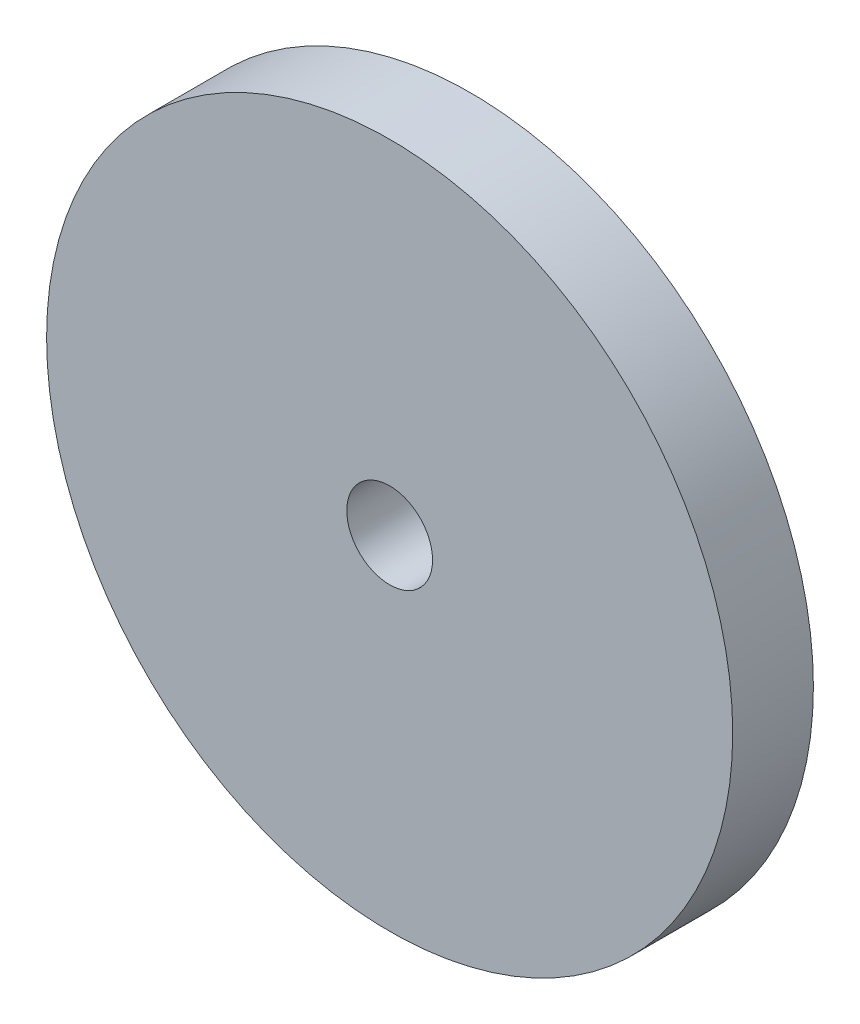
from build123d import *

# Parameters (mm, degrees)
SKETCH1_R           = 13.5
SKETCH1_R_2         = 1.6875
BOSS_EXTRUDE1_DEPTH = 3.175


with BuildPart() as part:
    # Sketch1 → Boss-Extrude1 (new body)
    with BuildSketch(Plane.XY):
        Circle(SKETCH1_R)
        Circle(SKETCH1_R_2, mode=Mode.SUBTRACT)
    extrude(amount=BOSS_EXTRUDE1_DEPTH)


solid = part.part
